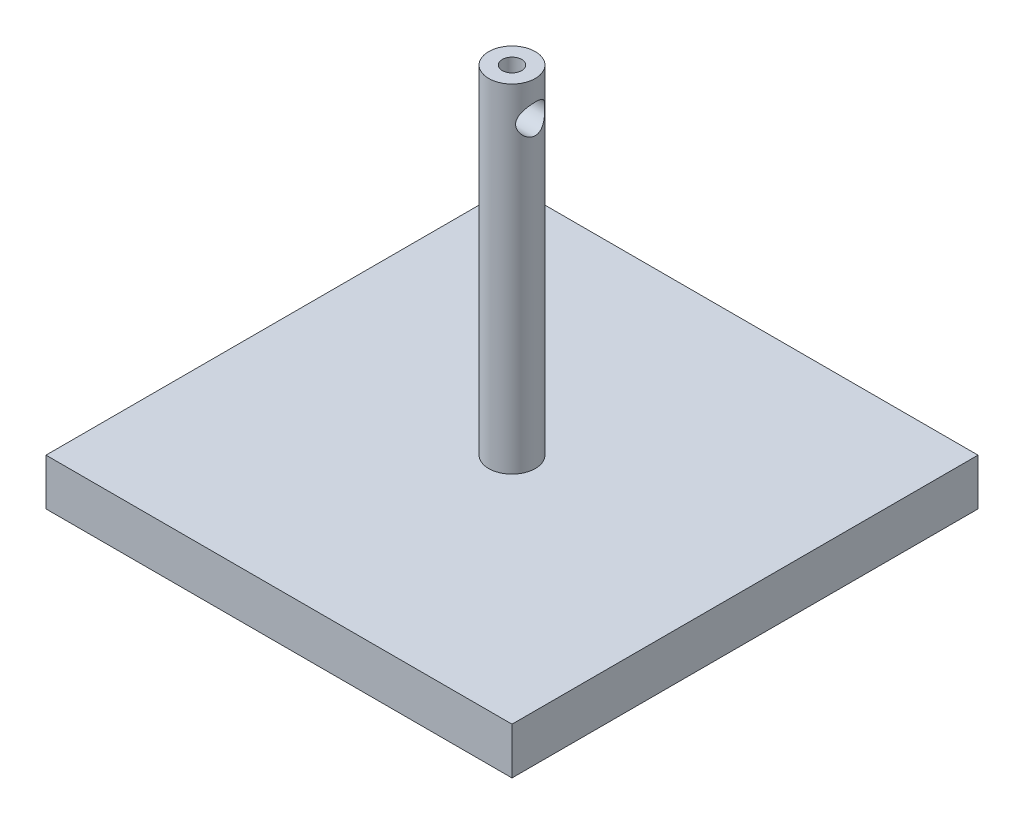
from build123d import *

# Parameters (mm, degrees)
SKETCH1_W               = 50.8
SKETCH1_H               = 50.8
BOSS_EXTRUDE1_DEPTH     = 5.08
SKETCH2_R               = 2.54
BOSS_EXTRUDE2_DEPTH     = 36.83
CUT_EXTRUDE1_DEPTH      = 56.197537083
CUT_EXTRUDE1_DEPTH_BACK = 56.197537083
SKETCH3_R               = 1.5875
CUT_EXTRUDE2_REACH      = 57.198
CUT_EXTRUDE2_END_RADIUS = 1.5875
SKETCH4_R               = 1.058333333
SKETCH6_R               = 4.064
CUT_EXTRUDE4_DEPTH      = 2.54


with BuildPart() as part:
    # Sketch1 → Boss-Extrude1 (new body)
    with BuildSketch(Plane(origin=(0, 0, 0), x_dir=(1, 0, 0), z_dir=(0, 1, 0))):
        Rectangle(SKETCH1_W, SKETCH1_H)
    extrude(amount=BOSS_EXTRUDE1_DEPTH)

    # Sketch2 → Boss-Extrude2 (add)
    with BuildSketch(Plane(origin=(0, 5.08, 0), x_dir=(1, 0, 0), z_dir=(0, 1, 0))):
        with Locations(Location((0, 0, 0), (0, 0, 90))):
            Circle(SKETCH2_R)
    extrude(amount=BOSS_EXTRUDE2_DEPTH)

    # Sketch3 → Cut-Extrude1 (cut, two sides: drawn at the far end of the back side and taken through both)
    with BuildSketch(Plane(origin=(0, 0, 0), x_dir=(0, 0, -1), z_dir=(1, 0, 0)).offset(-CUT_EXTRUDE1_DEPTH_BACK)):
        with Locations((0, 38.1)):
            Circle(SKETCH3_R)
    extrude(amount=CUT_EXTRUDE1_DEPTH + CUT_EXTRUDE1_DEPTH_BACK, mode=Mode.SUBTRACT)

    # Cut-Extrude2: up to this cylinder (the profile starts outside it)
    cut_extrude2_end = Plane(origin=(0, 38.1, 0), z_dir=(1, 0, 0)) * Cylinder(CUT_EXTRUDE2_END_RADIUS, 118.571, mode=Mode.PRIVATE)
    # Sketch4 → Cut-Extrude2 (cut, up to the surface)
    with BuildSketch(Plane(origin=(0, 41.91, 0), x_dir=(1, 0, 0), z_dir=(0, 1, 0)), mode=Mode.PRIVATE) as cut_extrude2_sk1:
        with Locations(Location((0, 0, 0), (0, 0, 270))):
            Circle(SKETCH4_R)
    cut_extrude2_tool1 = extrude(cut_extrude2_sk1.sketch, amount=-CUT_EXTRUDE2_REACH, mode=Mode.PRIVATE) - cut_extrude2_end
    add(cut_extrude2_tool1.solids().sort_by_distance((0, 41.91, 0))[0], mode=Mode.SUBTRACT)

    # Sketch6 → Cut-Extrude4 (cut)
    with BuildSketch(Plane.XZ):
        with Locations(Location((0, 0, 0), (0, 0, 270))):
            Circle(SKETCH6_R)
    extrude(amount=-CUT_EXTRUDE4_DEPTH, mode=Mode.SUBTRACT)


solid = part.part
